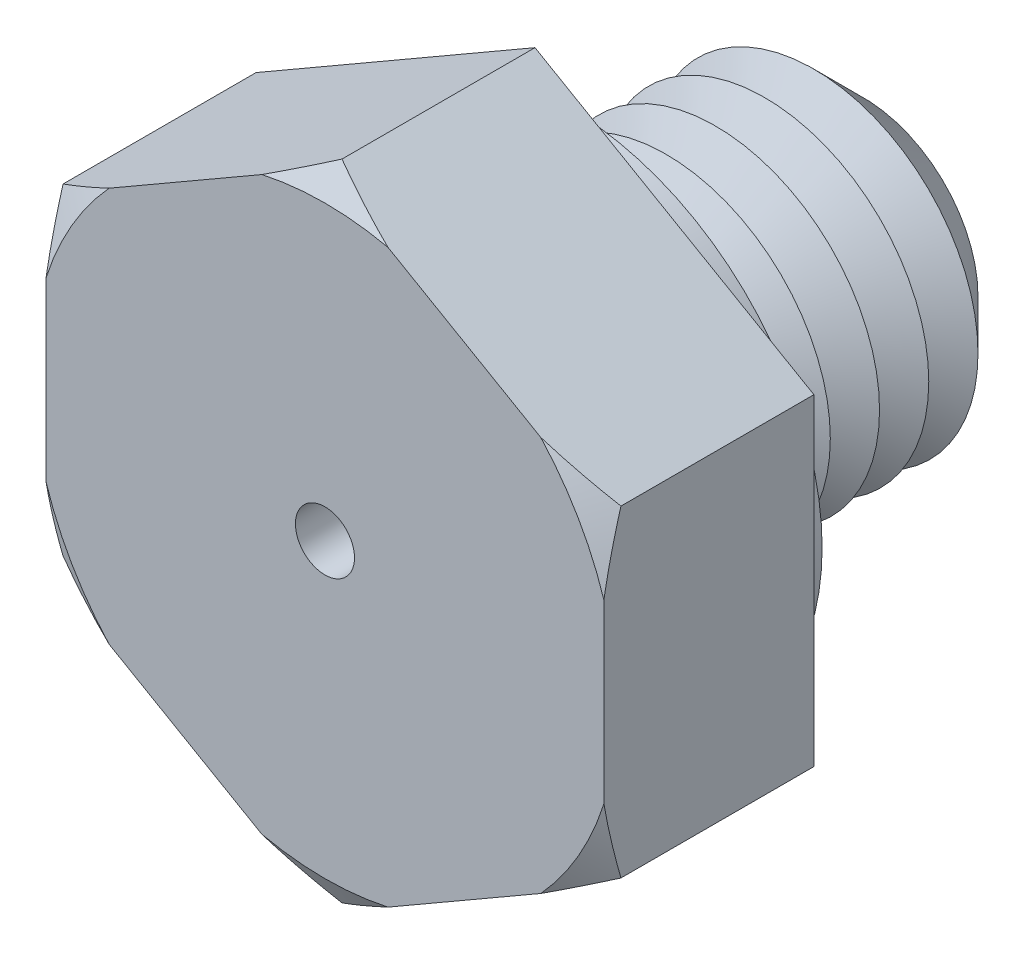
ISO-10303-21;
HEADER;
FILE_DESCRIPTION(('STEP AP214'),'2;1');
FILE_NAME('part.step','',(''),(''),'','','');
FILE_SCHEMA(('AUTOMOTIVE_DESIGN { 1 0 10303 214 1 1 1 1 }'));
ENDSEC;
DATA;
#1=APPLICATION_CONTEXT('core data for automotive mechanical design processes');
#2=APPLICATION_PROTOCOL_DEFINITION('international standard','automotive_design',2000,#1);
#3=PRODUCT_CONTEXT('',#1,'mechanical');
#4=PRODUCT('Part','Part','',(#3));
#5=PRODUCT_RELATED_PRODUCT_CATEGORY('part','',(#4));
#6=PRODUCT_DEFINITION_FORMATION('','',#4);
#7=PRODUCT_DEFINITION_CONTEXT('part definition',#1,'design');
#8=PRODUCT_DEFINITION('design','',#6,#7);
#9=PRODUCT_DEFINITION_SHAPE('','',#8);
#10=(LENGTH_UNIT() NAMED_UNIT(*) SI_UNIT(.MILLI.,.METRE.));
#11=(NAMED_UNIT(*) PLANE_ANGLE_UNIT() SI_UNIT($,.RADIAN.));
#12=(NAMED_UNIT(*) SI_UNIT($,.STERADIAN.) SOLID_ANGLE_UNIT());
#13=UNCERTAINTY_MEASURE_WITH_UNIT(LENGTH_MEASURE(1.E-05),#10,'distance_accuracy_value','');
#14=(GEOMETRIC_REPRESENTATION_CONTEXT(3) GLOBAL_UNCERTAINTY_ASSIGNED_CONTEXT((#13)) GLOBAL_UNIT_ASSIGNED_CONTEXT((#10,
#11,#12)) REPRESENTATION_CONTEXT('',''));
#15=CARTESIAN_POINT('',(0.,0.,0.));
#16=DIRECTION('',(0.,0.,1.));
#17=DIRECTION('',(1.,0.,0.));
#18=AXIS2_PLACEMENT_3D('',#15,#16,#17);
#19=CARTESIAN_POINT('',(8.5,4.90747728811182,6.4));
#20=DIRECTION('',(-0.5,-0.866025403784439,0.));
#21=DIRECTION('',(0.866025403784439,-0.5,0.));
#22=AXIS2_PLACEMENT_3D('',#19,#20,#21);
#23=PLANE('',#22);
#24=CARTESIAN_POINT('',(14.3974196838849,1.50260044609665,3.18954977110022));
#25=CARTESIAN_POINT('',(14.1303849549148,1.65677301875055,3.33361874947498));
#26=CARTESIAN_POINT('',(13.8627107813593,1.81131477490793,3.47613168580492));
#27=CARTESIAN_POINT('',(13.3258139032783,2.12129233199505,3.75731467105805));
#28=CARTESIAN_POINT('',(13.0565910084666,2.27672824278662,3.89598423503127));
#29=CARTESIAN_POINT('',(12.5155257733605,2.58911240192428,4.16915145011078));
#30=CARTESIAN_POINT('',(12.2436777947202,2.74606390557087,4.30363425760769));
#31=CARTESIAN_POINT('',(11.697943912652,3.06114350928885,4.56695627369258));
#32=CARTESIAN_POINT('',(11.4240580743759,3.21927157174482,4.69579566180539));
#33=CARTESIAN_POINT('',(10.8669438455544,3.54092162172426,4.94977636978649));
#34=CARTESIAN_POINT('',(10.5836547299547,3.70447866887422,5.07474091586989));
#35=CARTESIAN_POINT('',(10.0142178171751,4.03324322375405,5.31575754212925));
#36=CARTESIAN_POINT('',(9.72806988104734,4.19845081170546,5.43180918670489));
#37=CARTESIAN_POINT('',(9.15284957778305,4.53055440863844,5.6527883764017));
#38=CARTESIAN_POINT('',(8.86378033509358,4.69744861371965,5.75772666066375));
#39=CARTESIAN_POINT('',(8.28224800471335,5.03319646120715,5.95405449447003));
#40=CARTESIAN_POINT('',(7.98978536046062,5.20204984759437,6.04544579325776));
#41=CARTESIAN_POINT('',(7.29029341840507,5.60590170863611,6.24311258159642));
#42=CARTESIAN_POINT('',(6.88163396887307,5.8418413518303,6.34201308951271));
#43=CARTESIAN_POINT('',(6.26447173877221,6.1981601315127,6.46082851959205));
#44=CARTESIAN_POINT('',(6.0580654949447,6.31732883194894,6.49551015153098));
#45=CARTESIAN_POINT('',(5.64409758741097,6.5563333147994,6.55416143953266));
#46=CARTESIAN_POINT('',(5.43653593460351,6.67616909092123,6.57813119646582));
#47=CARTESIAN_POINT('',(5.02306823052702,6.91488478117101,6.6144556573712));
#48=CARTESIAN_POINT('',(4.81717088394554,7.03375966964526,6.62694180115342));
#49=CARTESIAN_POINT('',(4.40509314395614,7.27167286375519,6.64040244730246));
#50=CARTESIAN_POINT('',(4.19891275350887,7.39071116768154,6.64137706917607));
#51=CARTESIAN_POINT('',(3.7867555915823,7.62867021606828,6.63178359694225));
#52=CARTESIAN_POINT('',(3.58077881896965,7.747590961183,6.62121556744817));
#53=CARTESIAN_POINT('',(3.16946579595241,7.9850626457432,6.58885652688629));
#54=CARTESIAN_POINT('',(2.96412965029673,8.10361352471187,6.56706376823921));
#55=CARTESIAN_POINT('',(2.47890311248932,8.38375919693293,6.50285520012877));
#56=CARTESIAN_POINT('',(2.19947000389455,8.54508997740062,6.45579627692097));
#57=CARTESIAN_POINT('',(1.64328177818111,8.86620539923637,6.34397240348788));
#58=CARTESIAN_POINT('',(1.36652705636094,9.02598981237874,6.27920487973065));
#59=CARTESIAN_POINT('',(0.815728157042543,9.34399370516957,6.13440902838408));
#60=CARTESIAN_POINT('',(0.541687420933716,9.50221119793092,6.05436342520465));
#61=CARTESIAN_POINT('',(-0.00331670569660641,9.8168694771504,5.88153285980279));
#62=CARTESIAN_POINT('',(-0.27428028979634,9.97331037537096,5.788748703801));
#63=CARTESIAN_POINT('',(-0.816522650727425,10.2863741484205,5.59147835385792));
#64=CARTESIAN_POINT('',(-1.08776675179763,10.4429770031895,5.48686595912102));
#65=CARTESIAN_POINT('',(-1.6273814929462,10.7545237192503,5.26886764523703));
#66=CARTESIAN_POINT('',(-1.89575390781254,10.9094686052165,5.15548754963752));
#67=CARTESIAN_POINT('',(-2.43005320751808,11.2179464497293,4.92150983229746));
#68=CARTESIAN_POINT('',(-2.69598059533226,11.3714796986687,4.80091373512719));
#69=CARTESIAN_POINT('',(-3.2257511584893,11.6773428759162,4.55376737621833));
#70=CARTESIAN_POINT('',(-3.48959429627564,11.829672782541,4.42721700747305));
#71=CARTESIAN_POINT('',(-3.93372596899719,12.0860923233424,4.20929972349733));
#72=CARTESIAN_POINT('',(-4.1144919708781,12.1904576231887,4.1192248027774));
#73=CARTESIAN_POINT('',(-4.4752372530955,12.3987340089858,3.93701701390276));
#74=CARTESIAN_POINT('',(-4.65521655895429,12.5026451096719,3.84488421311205));
#75=CARTESIAN_POINT('',(-5.01258669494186,12.7089728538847,3.65977671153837));
#76=CARTESIAN_POINT('',(-5.18998489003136,12.8113937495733,3.56682094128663));
#77=CARTESIAN_POINT('',(-5.54415606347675,13.0158745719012,3.3793246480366));
#78=CARTESIAN_POINT('',(-5.72092903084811,13.1179344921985,3.28478409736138));
#79=CARTESIAN_POINT('',(-5.89741968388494,13.2198314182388,3.18954977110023));
#80=B_SPLINE_CURVE_WITH_KNOTS('',3,(#24,#25,#26,#27,#28,#29,#30,#31,#32,#33,#34,#35,#36,#37,#38,
#39,#40,#41,#42,#43,#44,#45,#46,#47,#48,#49,#50,#51,#52,#53,#54,#55,#56,#57,#58,#59,#60,#61,#62,
#63,#64,#65,#66,#67,#68,#69,#70,#71,#72,#73,#74,#75,#76,#77,#78,#79),.UNSPECIFIED.,.F.,.F.,(4,2,
2,2,2,2,2,2,2,2,2,2,2,2,2,2,2,2,2,2,2,2,2,2,2,2,2,4),(0.,1.02103660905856,2.04220146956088,
3.06664888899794,4.09106369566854,5.14147070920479,6.19192902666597,7.24136281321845,
8.29066097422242,9.73548564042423,10.45782862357,11.1801648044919,11.8941264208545,
12.6080806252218,13.3220308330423,14.036092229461,15.0137259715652,15.9915018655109,
16.9703899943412,17.9492161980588,18.939699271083,19.9295300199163,20.9191523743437,
21.9087925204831,22.5907917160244,23.272768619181,23.947601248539,24.622445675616),.UNSPECIFIED.);
#81=CARTESIAN_POINT('',(8.5,4.90747728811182,5.88038475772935));
#82=VERTEX_POINT('',#81);
#83=CARTESIAN_POINT('',(6.57804882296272,6.01711631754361,6.4));
#84=VERTEX_POINT('',#83);
#85=EDGE_CURVE('E132',#82,#84,#80,.T.);
#86=ORIENTED_EDGE('',*,*,#85,.F.);
#87=DIRECTION('',(0.,0.,-1.));
#88=VECTOR('',#87,1.);
#89=CARTESIAN_POINT('',(8.5,4.90747728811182,6.4));
#90=LINE('',#89,#88);
#91=CARTESIAN_POINT('',(8.5,4.90747728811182,0.));
#92=VERTEX_POINT('',#91);
#93=EDGE_CURVE('E144',#82,#92,#90,.T.);
#94=ORIENTED_EDGE('',*,*,#93,.T.);
#95=DIRECTION('',(-0.866025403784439,0.5,0.));
#96=VECTOR('',#95,1.);
#97=CARTESIAN_POINT('',(8.5,4.90747728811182,0.));
#98=LINE('',#97,#96);
#99=CARTESIAN_POINT('',(0.,9.81495457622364,0.));
#100=VERTEX_POINT('',#99);
#101=EDGE_CURVE('E236',#92,#100,#98,.T.);
#102=ORIENTED_EDGE('',*,*,#101,.T.);
#103=DIRECTION('',(0.,0.,-1.));
#104=VECTOR('',#103,1.);
#105=CARTESIAN_POINT('',(0.,9.81495457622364,6.4));
#106=LINE('',#105,#104);
#107=CARTESIAN_POINT('',(0.,9.81495457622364,5.88038475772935));
#108=VERTEX_POINT('',#107);
#109=EDGE_CURVE('E178',#108,#100,#106,.T.);
#110=ORIENTED_EDGE('',*,*,#109,.F.);
#111=CARTESIAN_POINT('',(1.92195117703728,8.70531554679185,6.4));
#112=VERTEX_POINT('',#111);
#113=EDGE_CURVE('E151',#112,#108,#80,.T.);
#114=ORIENTED_EDGE('',*,*,#113,.F.);
#115=DIRECTION('',(-0.866025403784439,0.5,0.));
#116=VECTOR('',#115,1.);
#117=CARTESIAN_POINT('',(8.5,4.90747728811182,6.4));
#118=LINE('',#117,#116);
#119=EDGE_CURVE('E148',#84,#112,#118,.T.);
#120=ORIENTED_EDGE('',*,*,#119,.F.);
#121=EDGE_LOOP('',(#86,#94,#102,#110,#114,#120));
#122=FACE_BOUND('',#121,.T.);
#123=ADVANCED_FACE('F39',(#122),#23,.F.);
#124=CARTESIAN_POINT('',(0.,9.81495457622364,6.4));
#125=DIRECTION('',(0.5,-0.866025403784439,0.));
#126=DIRECTION('',(0.866025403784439,0.5,0.));
#127=AXIS2_PLACEMENT_3D('',#124,#125,#126);
#128=PLANE('',#127);
#129=CARTESIAN_POINT('',(5.89741968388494,13.2198314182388,3.18954977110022));
#130=CARTESIAN_POINT('',(5.63038495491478,13.0656588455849,3.33361874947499));
#131=CARTESIAN_POINT('',(5.36271078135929,12.9111170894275,3.47613168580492));
#132=CARTESIAN_POINT('',(4.82581390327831,12.6011395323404,3.75731467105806));
#133=CARTESIAN_POINT('',(4.55659100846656,12.4457036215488,3.89598423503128));
#134=CARTESIAN_POINT('',(4.01552577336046,12.1333194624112,4.16915145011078));
#135=CARTESIAN_POINT('',(3.74367779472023,11.9763679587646,4.30363425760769));
#136=CARTESIAN_POINT('',(3.19794391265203,11.6612883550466,4.56695627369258));
#137=CARTESIAN_POINT('',(2.92405807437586,11.5031602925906,4.69579566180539));
#138=CARTESIAN_POINT('',(2.36694384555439,11.1815102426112,4.9497763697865));
#139=CARTESIAN_POINT('',(2.08365472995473,11.0179531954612,5.0747409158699));
#140=CARTESIAN_POINT('',(1.51421781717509,10.6891886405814,5.31575754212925));
#141=CARTESIAN_POINT('',(1.22806988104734,10.52398105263,5.4318091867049));
#142=CARTESIAN_POINT('',(0.652849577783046,10.191877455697,5.6527883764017));
#143=CARTESIAN_POINT('',(0.363780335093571,10.0249832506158,5.75772666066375));
#144=CARTESIAN_POINT('',(-0.21775199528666,9.68923540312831,5.95405449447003));
#145=CARTESIAN_POINT('',(-0.510214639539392,9.52038201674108,6.04544579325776));
#146=CARTESIAN_POINT('',(-1.20970658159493,9.11653015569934,6.24311258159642));
#147=CARTESIAN_POINT('',(-1.61836603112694,8.88059051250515,6.34201308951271));
#148=CARTESIAN_POINT('',(-2.2355282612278,8.52427173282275,6.46082851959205));
#149=CARTESIAN_POINT('',(-2.44193450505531,8.40510303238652,6.49551015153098));
#150=CARTESIAN_POINT('',(-2.85590241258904,8.16609854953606,6.55416143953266));
#151=CARTESIAN_POINT('',(-3.06346406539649,8.04626277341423,6.57813119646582));
#152=CARTESIAN_POINT('',(-3.47693176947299,7.80754708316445,6.6144556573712));
#153=CARTESIAN_POINT('',(-3.68282911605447,7.6886721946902,6.62694180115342));
#154=CARTESIAN_POINT('',(-4.09490685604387,7.45075900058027,6.64040244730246));
#155=CARTESIAN_POINT('',(-4.30108724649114,7.33172069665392,6.64137706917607));
#156=CARTESIAN_POINT('',(-4.71324440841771,7.09376164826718,6.63178359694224));
#157=CARTESIAN_POINT('',(-4.91922118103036,6.97484090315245,6.62121556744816));
#158=CARTESIAN_POINT('',(-5.3305342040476,6.73736921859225,6.58885652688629));
#159=CARTESIAN_POINT('',(-5.53587034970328,6.61881833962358,6.56706376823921));
#160=CARTESIAN_POINT('',(-6.02109688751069,6.33867266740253,6.50285520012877));
#161=CARTESIAN_POINT('',(-6.30052999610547,6.17734188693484,6.45579627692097));
#162=CARTESIAN_POINT('',(-6.8567182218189,5.85622646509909,6.34397240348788));
#163=CARTESIAN_POINT('',(-7.13347294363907,5.69644205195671,6.27920487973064));
#164=CARTESIAN_POINT('',(-7.68427184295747,5.37843815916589,6.13440902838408));
#165=CARTESIAN_POINT('',(-7.9583125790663,5.22022066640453,6.05436342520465));
#166=CARTESIAN_POINT('',(-8.50331670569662,4.90556238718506,5.88153285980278));
#167=CARTESIAN_POINT('',(-8.77428028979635,4.74912148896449,5.788748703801));
#168=CARTESIAN_POINT('',(-9.31652265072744,4.43605771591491,5.59147835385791));
#169=CARTESIAN_POINT('',(-9.58776675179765,4.27945486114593,5.48686595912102));
#170=CARTESIAN_POINT('',(-10.1273814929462,3.96790814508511,5.26886764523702));
#171=CARTESIAN_POINT('',(-10.3957539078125,3.81296325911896,5.15548754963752));
#172=CARTESIAN_POINT('',(-10.9300532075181,3.50448541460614,4.92150983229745));
#173=CARTESIAN_POINT('',(-11.1959805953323,3.35095216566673,4.80091373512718));
#174=CARTESIAN_POINT('',(-11.7257511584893,3.04508898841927,4.55376737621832));
#175=CARTESIAN_POINT('',(-11.9895942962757,2.89275908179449,4.42721700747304));
#176=CARTESIAN_POINT('',(-12.4337259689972,2.63633954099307,4.20929972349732));
#177=CARTESIAN_POINT('',(-12.6144919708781,2.53197424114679,4.11922480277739));
#178=CARTESIAN_POINT('',(-12.9752372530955,2.32369785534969,3.93701701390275));
#179=CARTESIAN_POINT('',(-13.1552165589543,2.21978675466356,3.84488421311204));
#180=CARTESIAN_POINT('',(-13.5125866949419,2.0134590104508,3.65977671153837));
#181=CARTESIAN_POINT('',(-13.6899848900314,1.91103811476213,3.56682094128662));
#182=CARTESIAN_POINT('',(-14.0441560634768,1.70655729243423,3.37932464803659));
#183=CARTESIAN_POINT('',(-14.2209290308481,1.60449737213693,3.28478409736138));
#184=CARTESIAN_POINT('',(-14.3974196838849,1.50260044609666,3.18954977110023));
#185=B_SPLINE_CURVE_WITH_KNOTS('',3,(#129,#130,#131,#132,#133,#134,#135,#136,#137,#138,#139,
#140,#141,#142,#143,#144,#145,#146,#147,#148,#149,#150,#151,#152,#153,#154,#155,#156,#157,#158,
#159,#160,#161,#162,#163,#164,#165,#166,#167,#168,#169,#170,#171,#172,#173,#174,#175,#176,#177,
#178,#179,#180,#181,#182,#183,#184),.UNSPECIFIED.,.F.,.F.,(4,2,2,2,2,2,2,2,2,2,2,2,2,2,2,2,2,2,
2,2,2,2,2,2,2,2,2,4),(0.,1.02103660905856,2.04220146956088,3.06664888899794,4.09106369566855,
5.1414707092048,6.19192902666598,7.24136281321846,8.29066097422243,9.73548564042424,
10.45782862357,11.1801648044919,11.8941264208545,12.6080806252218,13.3220308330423,
14.036092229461,15.0137259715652,15.991501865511,16.9703899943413,17.9492161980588,
18.939699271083,19.9295300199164,20.9191523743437,21.9087925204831,22.5907917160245,
23.272768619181,23.947601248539,24.622445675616),.UNSPECIFIED.);
#186=CARTESIAN_POINT('',(-1.92195117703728,8.70531554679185,6.4));
#187=VERTEX_POINT('',#186);
#188=EDGE_CURVE('E310',#108,#187,#185,.T.);
#189=ORIENTED_EDGE('',*,*,#188,.F.);
#190=ORIENTED_EDGE('',*,*,#109,.T.);
#191=DIRECTION('',(-0.866025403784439,-0.5,0.));
#192=VECTOR('',#191,1.);
#193=CARTESIAN_POINT('',(0.,9.81495457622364,0.));
#194=LINE('',#193,#192);
#195=CARTESIAN_POINT('',(-8.5,4.90747728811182,0.));
#196=VERTEX_POINT('',#195);
#197=EDGE_CURVE('E238',#100,#196,#194,.T.);
#198=ORIENTED_EDGE('',*,*,#197,.T.);
#199=DIRECTION('',(0.,0.,-1.));
#200=VECTOR('',#199,1.);
#201=CARTESIAN_POINT('',(-8.5,4.90747728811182,6.4));
#202=LINE('',#201,#200);
#203=CARTESIAN_POINT('',(-8.5,4.90747728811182,5.88038475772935));
#204=VERTEX_POINT('',#203);
#205=EDGE_CURVE('E175',#204,#196,#202,.T.);
#206=ORIENTED_EDGE('',*,*,#205,.F.);
#207=CARTESIAN_POINT('',(-6.57804882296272,6.01711631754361,6.4));
#208=VERTEX_POINT('',#207);
#209=EDGE_CURVE('E302',#208,#204,#185,.T.);
#210=ORIENTED_EDGE('',*,*,#209,.F.);
#211=DIRECTION('',(-0.866025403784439,-0.5,0.));
#212=VECTOR('',#211,1.);
#213=CARTESIAN_POINT('',(0.,9.81495457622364,6.4));
#214=LINE('',#213,#212);
#215=EDGE_CURVE('E216',#187,#208,#214,.T.);
#216=ORIENTED_EDGE('',*,*,#215,.F.);
#217=EDGE_LOOP('',(#189,#190,#198,#206,#210,#216));
#218=FACE_BOUND('',#217,.T.);
#219=ADVANCED_FACE('F316',(#218),#128,.F.);
#220=CARTESIAN_POINT('',(-8.5,4.90747728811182,6.4));
#221=DIRECTION('',(1.,0.,0.));
#222=DIRECTION('',(0.,0.,-1.));
#223=AXIS2_PLACEMENT_3D('',#220,#221,#222);
#224=PLANE('',#223);
#225=CARTESIAN_POINT('',(-8.5,10.8048969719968,3.60988571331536));
#226=CARTESIAN_POINT('',(-8.5,10.4978348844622,3.74918346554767));
#227=CARTESIAN_POINT('',(-8.5,10.189932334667,3.88666386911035));
#228=CARTESIAN_POINT('',(-8.5,9.57208629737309,4.15710808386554));
#229=CARTESIAN_POINT('',(-8.5,9.26214245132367,4.29007107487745));
#230=CARTESIAN_POINT('',(-8.5,8.63866338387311,4.55109231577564));
#231=CARTESIAN_POINT('',(-8.5,8.32511856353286,4.67912772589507));
#232=CARTESIAN_POINT('',(-8.5,7.69537699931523,4.92848462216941));
#233=CARTESIAN_POINT('',(-8.5,7.37918037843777,5.04980641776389));
#234=CARTESIAN_POINT('',(-8.5,6.74517674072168,5.28371307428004));
#235=CARTESIAN_POINT('',(-8.5,6.4273834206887,5.39633487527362));
#236=CARTESIAN_POINT('',(-8.5,5.78839893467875,5.61161420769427));
#237=CARTESIAN_POINT('',(-8.5,5.46720760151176,5.7142712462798));
#238=CARTESIAN_POINT('',(-8.5,4.82159629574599,5.90726308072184));
#239=CARTESIAN_POINT('',(-8.5,4.49718135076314,5.99761456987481));
#240=CARTESIAN_POINT('',(-8.5,3.84456693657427,6.16359045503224));
#241=CARTESIAN_POINT('',(-8.5,3.51636763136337,6.23921548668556));
#242=CARTESIAN_POINT('',(-8.5,2.94974096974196,6.35404738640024));
#243=CARTESIAN_POINT('',(-8.5,2.71217469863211,6.39750509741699));
#244=CARTESIAN_POINT('',(-8.5,2.2354523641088,6.47441576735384));
#245=CARTESIAN_POINT('',(-8.5,1.99629657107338,6.50787038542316));
#246=CARTESIAN_POINT('',(-8.5,1.51674855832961,6.56389930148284));
#247=CARTESIAN_POINT('',(-8.5,1.27635657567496,6.58647561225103));
#248=CARTESIAN_POINT('',(-8.5,0.794760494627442,6.62010098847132));
#249=CARTESIAN_POINT('',(-8.5,0.553556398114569,6.63115008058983));
#250=CARTESIAN_POINT('',(-8.5,0.0710159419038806,6.64137634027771));
#251=CARTESIAN_POINT('',(-8.5,-0.170320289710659,6.64055949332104));
#252=CARTESIAN_POINT('',(-8.5,-0.65265778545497,6.62709447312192));
#253=CARTESIAN_POINT('',(-8.5,-0.893659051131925,6.61444635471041));
#254=CARTESIAN_POINT('',(-8.5,-1.3748063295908,6.57770491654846));
#255=CARTESIAN_POINT('',(-8.5,-1.61495224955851,6.55361039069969));
#256=CARTESIAN_POINT('',(-8.5,-2.09391419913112,6.49466927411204));
#257=CARTESIAN_POINT('',(-8.5,-2.33273017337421,6.45982223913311));
#258=CARTESIAN_POINT('',(-8.5,-2.92716537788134,6.36046793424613));
#259=CARTESIAN_POINT('',(-8.5,-3.28176466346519,6.28983043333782));
#260=CARTESIAN_POINT('',(-8.5,-3.98672843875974,6.12983266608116));
#261=CARTESIAN_POINT('',(-8.5,-4.33709179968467,6.04046752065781));
#262=CARTESIAN_POINT('',(-8.5,-5.03425422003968,5.84616571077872));
#263=CARTESIAN_POINT('',(-8.5,-5.38104385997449,5.74119557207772));
#264=CARTESIAN_POINT('',(-8.5,-6.07054103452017,5.51879279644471));
#265=CARTESIAN_POINT('',(-8.5,-6.41324885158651,5.40136102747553));
#266=CARTESIAN_POINT('',(-8.5,-7.0989182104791,5.15508322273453));
#267=CARTESIAN_POINT('',(-8.5,-7.4418383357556,5.02612259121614));
#268=CARTESIAN_POINT('',(-8.5,-8.12447486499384,4.75996128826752));
#269=CARTESIAN_POINT('',(-8.5,-8.46419106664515,4.62276010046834));
#270=CARTESIAN_POINT('',(-8.5,-9.13876623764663,4.34260011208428));
#271=CARTESIAN_POINT('',(-8.5,-9.47364225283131,4.1996821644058));
#272=CARTESIAN_POINT('',(-8.5,-10.1409696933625,3.90850505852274));
#273=CARTESIAN_POINT('',(-8.5,-10.4734216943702,3.76024722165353));
#274=CARTESIAN_POINT('',(-8.5,-10.8048969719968,3.60988571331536));
#275=B_SPLINE_CURVE_WITH_KNOTS('',3,(#225,#226,#227,#228,#229,#230,#231,#232,#233,#234,#235,
#236,#237,#238,#239,#240,#241,#242,#243,#244,#245,#246,#247,#248,#249,#250,#251,#252,#253,#254,
#255,#256,#257,#258,#259,#260,#261,#262,#263,#264,#265,#266,#267,#268,#269,#270,#271,#272,#273,
#274),.UNSPECIFIED.,.F.,.F.,(4,2,2,2,2,2,2,2,2,2,2,2,2,2,2,2,2,2,2,2,2,2,2,2,4),(0.,
1.01155870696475,2.02330010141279,3.03927305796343,4.05519914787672,5.06654285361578,
6.07793655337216,7.08794426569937,8.0979083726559,8.82224854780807,9.54646851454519,
10.2705544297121,10.9946386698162,11.7183576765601,12.4420733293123,13.1658652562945,
13.8896870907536,14.9737367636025,16.0580692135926,17.1447621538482,18.2313794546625,
19.3303511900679,20.4293918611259,21.5216359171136,22.6136115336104),.UNSPECIFIED.);
#276=CARTESIAN_POINT('',(-8.5,2.68819922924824,6.4));
#277=VERTEX_POINT('',#276);
#278=EDGE_CURVE('E223',#204,#277,#275,.T.);
#279=ORIENTED_EDGE('',*,*,#278,.F.);
#280=ORIENTED_EDGE('',*,*,#205,.T.);
#281=DIRECTION('',(0.,-1.,0.));
#282=VECTOR('',#281,1.);
#283=CARTESIAN_POINT('',(-8.5,4.90747728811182,0.));
#284=LINE('',#283,#282);
#285=CARTESIAN_POINT('',(-8.5,-4.90747728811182,0.));
#286=VERTEX_POINT('',#285);
#287=EDGE_CURVE('E243',#196,#286,#284,.T.);
#288=ORIENTED_EDGE('',*,*,#287,.T.);
#289=DIRECTION('',(0.,0.,-1.));
#290=VECTOR('',#289,1.);
#291=CARTESIAN_POINT('',(-8.5,-4.90747728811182,6.4));
#292=LINE('',#291,#290);
#293=CARTESIAN_POINT('',(-8.5,-4.90747728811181,5.88038475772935));
#294=VERTEX_POINT('',#293);
#295=EDGE_CURVE('E172',#294,#286,#292,.T.);
#296=ORIENTED_EDGE('',*,*,#295,.F.);
#297=CARTESIAN_POINT('',(-8.5,-2.68819922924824,6.4));
#298=VERTEX_POINT('',#297);
#299=EDGE_CURVE('E226',#298,#294,#275,.T.);
#300=ORIENTED_EDGE('',*,*,#299,.F.);
#301=DIRECTION('',(0.,-1.,0.));
#302=VECTOR('',#301,1.);
#303=CARTESIAN_POINT('',(-8.5,4.90747728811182,6.4));
#304=LINE('',#303,#302);
#305=EDGE_CURVE('E214',#277,#298,#304,.T.);
#306=ORIENTED_EDGE('',*,*,#305,.F.);
#307=EDGE_LOOP('',(#279,#280,#288,#296,#300,#306));
#308=FACE_BOUND('',#307,.T.);
#309=ADVANCED_FACE('F222',(#308),#224,.F.);
#310=CARTESIAN_POINT('',(-8.5,-4.90747728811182,6.4));
#311=DIRECTION('',(0.5,0.866025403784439,0.));
#312=DIRECTION('',(-0.866025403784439,0.5,0.));
#313=AXIS2_PLACEMENT_3D('',#310,#311,#312);
#314=PLANE('',#313);
#315=CARTESIAN_POINT('',(-14.3974196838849,-1.50260044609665,3.18954977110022));
#316=CARTESIAN_POINT('',(-14.1303849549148,-1.65677301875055,3.33361874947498));
#317=CARTESIAN_POINT('',(-13.8627107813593,-1.81131477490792,3.47613168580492));
#318=CARTESIAN_POINT('',(-13.3258139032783,-2.12129233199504,3.75731467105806));
#319=CARTESIAN_POINT('',(-13.0565910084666,-2.27672824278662,3.89598423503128));
#320=CARTESIAN_POINT('',(-12.5155257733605,-2.58911240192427,4.16915145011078));
#321=CARTESIAN_POINT('',(-12.2436777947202,-2.74606390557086,4.30363425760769));
#322=CARTESIAN_POINT('',(-11.697943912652,-3.06114350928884,4.56695627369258));
#323=CARTESIAN_POINT('',(-11.4240580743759,-3.21927157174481,4.69579566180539));
#324=CARTESIAN_POINT('',(-10.8669438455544,-3.54092162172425,4.94977636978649));
#325=CARTESIAN_POINT('',(-10.5836547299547,-3.70447866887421,5.07474091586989));
#326=CARTESIAN_POINT('',(-10.0142178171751,-4.03324322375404,5.31575754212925));
#327=CARTESIAN_POINT('',(-9.72806988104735,-4.19845081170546,5.43180918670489));
#328=CARTESIAN_POINT('',(-9.15284957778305,-4.53055440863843,5.6527883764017));
#329=CARTESIAN_POINT('',(-8.86378033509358,-4.69744861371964,5.75772666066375));
#330=CARTESIAN_POINT('',(-8.28224800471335,-5.03319646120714,5.95405449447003));
#331=CARTESIAN_POINT('',(-7.98978536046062,-5.20204984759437,6.04544579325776));
#332=CARTESIAN_POINT('',(-7.29029341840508,-5.60590170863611,6.24311258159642));
#333=CARTESIAN_POINT('',(-6.88163396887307,-5.84184135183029,6.34201308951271));
#334=CARTESIAN_POINT('',(-6.26447173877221,-6.1981601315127,6.46082851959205));
#335=CARTESIAN_POINT('',(-6.0580654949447,-6.31732883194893,6.49551015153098));
#336=CARTESIAN_POINT('',(-5.64409758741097,-6.55633331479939,6.55416143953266));
#337=CARTESIAN_POINT('',(-5.43653593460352,-6.67616909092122,6.57813119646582));
#338=CARTESIAN_POINT('',(-5.02306823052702,-6.914884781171,6.6144556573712));
#339=CARTESIAN_POINT('',(-4.81717088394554,-7.03375966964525,6.62694180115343));
#340=CARTESIAN_POINT('',(-4.40509314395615,-7.27167286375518,6.64040244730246));
#341=CARTESIAN_POINT('',(-4.19891275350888,-7.39071116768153,6.64137706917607));
#342=CARTESIAN_POINT('',(-3.78675559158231,-7.62867021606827,6.63178359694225));
#343=CARTESIAN_POINT('',(-3.58077881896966,-7.74759096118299,6.62121556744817));
#344=CARTESIAN_POINT('',(-3.16946579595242,-7.98506264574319,6.58885652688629));
#345=CARTESIAN_POINT('',(-2.96412965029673,-8.10361352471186,6.56706376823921));
#346=CARTESIAN_POINT('',(-2.47890311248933,-8.38375919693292,6.50285520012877));
#347=CARTESIAN_POINT('',(-2.19947000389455,-8.54508997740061,6.45579627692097));
#348=CARTESIAN_POINT('',(-1.64328177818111,-8.86620539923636,6.34397240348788));
#349=CARTESIAN_POINT('',(-1.36652705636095,-9.02598981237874,6.27920487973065));
#350=CARTESIAN_POINT('',(-0.815728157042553,-9.34399370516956,6.13440902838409));
#351=CARTESIAN_POINT('',(-0.541687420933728,-9.50221119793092,6.05436342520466));
#352=CARTESIAN_POINT('',(0.00331670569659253,-9.81686947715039,5.8815328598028));
#353=CARTESIAN_POINT('',(0.274280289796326,-9.97331037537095,5.78874870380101));
#354=CARTESIAN_POINT('',(0.816522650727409,-10.2863741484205,5.59147835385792));
#355=CARTESIAN_POINT('',(1.08776675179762,-10.4429770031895,5.48686595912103));
#356=CARTESIAN_POINT('',(1.62738149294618,-10.7545237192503,5.26886764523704));
#357=CARTESIAN_POINT('',(1.89575390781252,-10.9094686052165,5.15548754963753));
#358=CARTESIAN_POINT('',(2.43005320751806,-11.2179464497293,4.92150983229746));
#359=CARTESIAN_POINT('',(2.69598059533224,-11.3714796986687,4.8009137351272));
#360=CARTESIAN_POINT('',(3.22575115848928,-11.6773428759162,4.55376737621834));
#361=CARTESIAN_POINT('',(3.48959429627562,-11.829672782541,4.42721700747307));
#362=CARTESIAN_POINT('',(3.93372596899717,-12.0860923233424,4.20929972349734));
#363=CARTESIAN_POINT('',(4.11449197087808,-12.1904576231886,4.11922480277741));
#364=CARTESIAN_POINT('',(4.47523725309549,-12.3987340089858,3.93701701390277));
#365=CARTESIAN_POINT('',(4.65521655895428,-12.5026451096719,3.84488421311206));
#366=CARTESIAN_POINT('',(5.01258669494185,-12.7089728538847,3.65977671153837));
#367=CARTESIAN_POINT('',(5.18998489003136,-12.8113937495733,3.56682094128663));
#368=CARTESIAN_POINT('',(5.54415606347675,-13.0158745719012,3.3793246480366));
#369=CARTESIAN_POINT('',(5.72092903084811,-13.1179344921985,3.28478409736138));
#370=CARTESIAN_POINT('',(5.89741968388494,-13.2198314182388,3.18954977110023));
#371=B_SPLINE_CURVE_WITH_KNOTS('',3,(#315,#316,#317,#318,#319,#320,#321,#322,#323,#324,#325,
#326,#327,#328,#329,#330,#331,#332,#333,#334,#335,#336,#337,#338,#339,#340,#341,#342,#343,#344,
#345,#346,#347,#348,#349,#350,#351,#352,#353,#354,#355,#356,#357,#358,#359,#360,#361,#362,#363,
#364,#365,#366,#367,#368,#369,#370),.UNSPECIFIED.,.F.,.F.,(4,2,2,2,2,2,2,2,2,2,2,2,2,2,2,2,2,2,
2,2,2,2,2,2,2,2,2,4),(0.,1.02103660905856,2.04220146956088,3.06664888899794,4.09106369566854,
5.14147070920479,6.19192902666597,7.24136281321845,8.29066097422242,9.73548564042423,
10.45782862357,11.1801648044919,11.8941264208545,12.6080806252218,13.3220308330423,
14.036092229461,15.0137259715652,15.9915018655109,16.9703899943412,17.9492161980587,
18.9396992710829,19.9295300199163,20.9191523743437,21.9087925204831,22.5907917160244,
23.272768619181,23.947601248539,24.622445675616),.UNSPECIFIED.);
#372=CARTESIAN_POINT('',(-6.57804882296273,-6.0171163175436,6.4));
#373=VERTEX_POINT('',#372);
#374=EDGE_CURVE('E353',#294,#373,#371,.T.);
#375=ORIENTED_EDGE('',*,*,#374,.F.);
#376=ORIENTED_EDGE('',*,*,#295,.T.);
#377=DIRECTION('',(0.866025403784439,-0.5,0.));
#378=VECTOR('',#377,1.);
#379=CARTESIAN_POINT('',(-8.5,-4.90747728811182,0.));
#380=LINE('',#379,#378);
#381=CARTESIAN_POINT('',(0.,-9.81495457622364,0.));
#382=VERTEX_POINT('',#381);
#383=EDGE_CURVE('E246',#286,#382,#380,.T.);
#384=ORIENTED_EDGE('',*,*,#383,.T.);
#385=DIRECTION('',(0.,0.,-1.));
#386=VECTOR('',#385,1.);
#387=CARTESIAN_POINT('',(0.,-9.81495457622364,6.4));
#388=LINE('',#387,#386);
#389=CARTESIAN_POINT('',(0.,-9.81495457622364,5.88038475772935));
#390=VERTEX_POINT('',#389);
#391=EDGE_CURVE('E162',#390,#382,#388,.T.);
#392=ORIENTED_EDGE('',*,*,#391,.F.);
#393=CARTESIAN_POINT('',(-1.92195117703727,-8.70531554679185,6.4));
#394=VERTEX_POINT('',#393);
#395=EDGE_CURVE('E347',#394,#390,#371,.T.);
#396=ORIENTED_EDGE('',*,*,#395,.F.);
#397=DIRECTION('',(0.866025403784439,-0.5,0.));
#398=VECTOR('',#397,1.);
#399=CARTESIAN_POINT('',(-8.5,-4.90747728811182,6.4));
#400=LINE('',#399,#398);
#401=EDGE_CURVE('E228',#373,#394,#400,.T.);
#402=ORIENTED_EDGE('',*,*,#401,.F.);
#403=EDGE_LOOP('',(#375,#376,#384,#392,#396,#402));
#404=FACE_BOUND('',#403,.T.);
#405=ADVANCED_FACE('F354',(#404),#314,.F.);
#406=CARTESIAN_POINT('',(0.,-9.81495457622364,6.4));
#407=DIRECTION('',(-0.5,0.866025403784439,0.));
#408=DIRECTION('',(-0.866025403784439,-0.5,0.));
#409=AXIS2_PLACEMENT_3D('',#406,#407,#408);
#410=PLANE('',#409);
#411=CARTESIAN_POINT('',(-5.89741968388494,-13.2198314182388,3.18954977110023));
#412=CARTESIAN_POINT('',(-5.63038495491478,-13.0656588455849,3.33361874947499));
#413=CARTESIAN_POINT('',(-5.36271078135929,-12.9111170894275,3.47613168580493));
#414=CARTESIAN_POINT('',(-4.82581390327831,-12.6011395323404,3.75731467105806));
#415=CARTESIAN_POINT('',(-4.55659100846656,-12.4457036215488,3.89598423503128));
#416=CARTESIAN_POINT('',(-4.01552577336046,-12.1333194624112,4.16915145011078));
#417=CARTESIAN_POINT('',(-3.74367779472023,-11.9763679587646,4.30363425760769));
#418=CARTESIAN_POINT('',(-3.19794391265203,-11.6612883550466,4.56695627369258));
#419=CARTESIAN_POINT('',(-2.92405807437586,-11.5031602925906,4.69579566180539));
#420=CARTESIAN_POINT('',(-2.3669438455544,-11.1815102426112,4.9497763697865));
#421=CARTESIAN_POINT('',(-2.08365472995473,-11.0179531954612,5.0747409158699));
#422=CARTESIAN_POINT('',(-1.51421781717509,-10.6891886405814,5.31575754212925));
#423=CARTESIAN_POINT('',(-1.22806988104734,-10.52398105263,5.4318091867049));
#424=CARTESIAN_POINT('',(-0.65284957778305,-10.191877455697,5.6527883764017));
#425=CARTESIAN_POINT('',(-0.363780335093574,-10.0249832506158,5.75772666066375));
#426=CARTESIAN_POINT('',(0.217751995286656,-9.68923540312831,5.95405449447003));
#427=CARTESIAN_POINT('',(0.510214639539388,-9.52038201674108,6.04544579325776));
#428=CARTESIAN_POINT('',(1.20970658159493,-9.11653015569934,6.24311258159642));
#429=CARTESIAN_POINT('',(1.61836603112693,-8.88059051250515,6.34201308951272));
#430=CARTESIAN_POINT('',(2.2355282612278,-8.52427173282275,6.46082851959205));
#431=CARTESIAN_POINT('',(2.44193450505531,-8.40510303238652,6.49551015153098));
#432=CARTESIAN_POINT('',(2.85590241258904,-8.16609854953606,6.55416143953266));
#433=CARTESIAN_POINT('',(3.06346406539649,-8.04626277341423,6.57813119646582));
#434=CARTESIAN_POINT('',(3.47693176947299,-7.80754708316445,6.6144556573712));
#435=CARTESIAN_POINT('',(3.68282911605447,-7.6886721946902,6.62694180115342));
#436=CARTESIAN_POINT('',(4.09490685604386,-7.45075900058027,6.64040244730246));
#437=CARTESIAN_POINT('',(4.30108724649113,-7.33172069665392,6.64137706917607));
#438=CARTESIAN_POINT('',(4.7132444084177,-7.09376164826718,6.63178359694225));
#439=CARTESIAN_POINT('',(4.91922118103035,-6.97484090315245,6.62121556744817));
#440=CARTESIAN_POINT('',(5.33053420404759,-6.73736921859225,6.58885652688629));
#441=CARTESIAN_POINT('',(5.53587034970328,-6.61881833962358,6.56706376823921));
#442=CARTESIAN_POINT('',(6.02109688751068,-6.33867266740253,6.50285520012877));
#443=CARTESIAN_POINT('',(6.30052999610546,-6.17734188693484,6.45579627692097));
#444=CARTESIAN_POINT('',(6.8567182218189,-5.85622646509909,6.34397240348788));
#445=CARTESIAN_POINT('',(7.13347294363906,-5.69644205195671,6.27920487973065));
#446=CARTESIAN_POINT('',(7.68427184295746,-5.37843815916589,6.13440902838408));
#447=CARTESIAN_POINT('',(7.95831257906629,-5.22022066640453,6.05436342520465));
#448=CARTESIAN_POINT('',(8.50331670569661,-4.90556238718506,5.88153285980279));
#449=CARTESIAN_POINT('',(8.77428028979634,-4.74912148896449,5.788748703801));
#450=CARTESIAN_POINT('',(9.31652265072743,-4.43605771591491,5.59147835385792));
#451=CARTESIAN_POINT('',(9.58776675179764,-4.27945486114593,5.48686595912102));
#452=CARTESIAN_POINT('',(10.1273814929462,-3.96790814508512,5.26886764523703));
#453=CARTESIAN_POINT('',(10.3957539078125,-3.81296325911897,5.15548754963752));
#454=CARTESIAN_POINT('',(10.9300532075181,-3.50448541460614,4.92150983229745));
#455=CARTESIAN_POINT('',(11.1959805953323,-3.35095216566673,4.80091373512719));
#456=CARTESIAN_POINT('',(11.7257511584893,-3.04508898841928,4.55376737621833));
#457=CARTESIAN_POINT('',(11.9895942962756,-2.8927590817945,4.42721700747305));
#458=CARTESIAN_POINT('',(12.4337259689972,-2.63633954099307,4.20929972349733));
#459=CARTESIAN_POINT('',(12.6144919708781,-2.5319742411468,4.11922480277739));
#460=CARTESIAN_POINT('',(12.9752372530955,-2.32369785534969,3.93701701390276));
#461=CARTESIAN_POINT('',(13.1552165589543,-2.21978675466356,3.84488421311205));
#462=CARTESIAN_POINT('',(13.5125866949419,-2.0134590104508,3.65977671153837));
#463=CARTESIAN_POINT('',(13.6899848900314,-1.91103811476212,3.56682094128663));
#464=CARTESIAN_POINT('',(14.0441560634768,-1.70655729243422,3.3793246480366));
#465=CARTESIAN_POINT('',(14.2209290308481,-1.60449737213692,3.28478409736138));
#466=CARTESIAN_POINT('',(14.3974196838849,-1.50260044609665,3.18954977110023));
#467=B_SPLINE_CURVE_WITH_KNOTS('',3,(#411,#412,#413,#414,#415,#416,#417,#418,#419,#420,#421,
#422,#423,#424,#425,#426,#427,#428,#429,#430,#431,#432,#433,#434,#435,#436,#437,#438,#439,#440,
#441,#442,#443,#444,#445,#446,#447,#448,#449,#450,#451,#452,#453,#454,#455,#456,#457,#458,#459,
#460,#461,#462,#463,#464,#465,#466),.UNSPECIFIED.,.F.,.F.,(4,2,2,2,2,2,2,2,2,2,2,2,2,2,2,2,2,2,
2,2,2,2,2,2,2,2,2,4),(0.,1.02103660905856,2.04220146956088,3.06664888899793,4.09106369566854,
5.14147070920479,6.19192902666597,7.24136281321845,8.29066097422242,9.73548564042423,
10.45782862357,11.1801648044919,11.8941264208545,12.6080806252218,13.3220308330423,
14.036092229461,15.0137259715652,15.9915018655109,16.9703899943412,17.9492161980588,
18.939699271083,19.9295300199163,20.9191523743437,21.9087925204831,22.5907917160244,
23.272768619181,23.947601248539,24.622445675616),.UNSPECIFIED.);
#468=CARTESIAN_POINT('',(1.92195117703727,-8.70531554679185,6.4));
#469=VERTEX_POINT('',#468);
#470=EDGE_CURVE('E64',#390,#469,#467,.T.);
#471=ORIENTED_EDGE('',*,*,#470,.F.);
#472=ORIENTED_EDGE('',*,*,#391,.T.);
#473=DIRECTION('',(0.866025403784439,0.5,0.));
#474=VECTOR('',#473,1.);
#475=CARTESIAN_POINT('',(0.,-9.81495457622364,0.));
#476=LINE('',#475,#474);
#477=CARTESIAN_POINT('',(8.5,-4.90747728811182,0.));
#478=VERTEX_POINT('',#477);
#479=EDGE_CURVE('E249',#382,#478,#476,.T.);
#480=ORIENTED_EDGE('',*,*,#479,.T.);
#481=DIRECTION('',(0.,0.,-1.));
#482=VECTOR('',#481,1.);
#483=CARTESIAN_POINT('',(8.5,-4.90747728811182,6.4));
#484=LINE('',#483,#482);
#485=CARTESIAN_POINT('',(8.5,-4.90747728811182,5.88038475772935));
#486=VERTEX_POINT('',#485);
#487=EDGE_CURVE('E157',#486,#478,#484,.T.);
#488=ORIENTED_EDGE('',*,*,#487,.F.);
#489=CARTESIAN_POINT('',(6.57804882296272,-6.01711631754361,6.4));
#490=VERTEX_POINT('',#489);
#491=EDGE_CURVE('E342',#490,#486,#467,.T.);
#492=ORIENTED_EDGE('',*,*,#491,.F.);
#493=DIRECTION('',(0.866025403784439,0.5,0.));
#494=VECTOR('',#493,1.);
#495=CARTESIAN_POINT('',(0.,-9.81495457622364,6.4));
#496=LINE('',#495,#494);
#497=EDGE_CURVE('E165',#469,#490,#496,.T.);
#498=ORIENTED_EDGE('',*,*,#497,.F.);
#499=EDGE_LOOP('',(#471,#472,#480,#488,#492,#498));
#500=FACE_BOUND('',#499,.T.);
#501=ADVANCED_FACE('F357',(#500),#410,.F.);
#502=CARTESIAN_POINT('',(8.5,-4.90747728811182,6.4));
#503=DIRECTION('',(-1.,0.,0.));
#504=DIRECTION('',(0.,-1.,0.));
#505=AXIS2_PLACEMENT_3D('',#502,#503,#504);
#506=PLANE('',#505);
#507=CARTESIAN_POINT('',(8.5,-10.8048969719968,3.60988571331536));
#508=CARTESIAN_POINT('',(8.5,-10.4978348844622,3.74918346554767));
#509=CARTESIAN_POINT('',(8.5,-10.189932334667,3.88666386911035));
#510=CARTESIAN_POINT('',(8.5,-9.57208629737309,4.15710808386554));
#511=CARTESIAN_POINT('',(8.5,-9.26214245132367,4.29007107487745));
#512=CARTESIAN_POINT('',(8.5,-8.63866338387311,4.55109231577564));
#513=CARTESIAN_POINT('',(8.5,-8.32511856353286,4.67912772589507));
#514=CARTESIAN_POINT('',(8.5,-7.69537699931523,4.92848462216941));
#515=CARTESIAN_POINT('',(8.5,-7.37918037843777,5.04980641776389));
#516=CARTESIAN_POINT('',(8.5,-6.74517674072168,5.28371307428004));
#517=CARTESIAN_POINT('',(8.5,-6.4273834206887,5.39633487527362));
#518=CARTESIAN_POINT('',(8.5,-5.78839893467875,5.61161420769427));
#519=CARTESIAN_POINT('',(8.5,-5.46720760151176,5.7142712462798));
#520=CARTESIAN_POINT('',(8.5,-4.82159629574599,5.90726308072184));
#521=CARTESIAN_POINT('',(8.5,-4.49718135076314,5.99761456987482));
#522=CARTESIAN_POINT('',(8.5,-3.84456693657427,6.16359045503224));
#523=CARTESIAN_POINT('',(8.5,-3.51636763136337,6.23921548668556));
#524=CARTESIAN_POINT('',(8.5,-2.94974096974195,6.35404738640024));
#525=CARTESIAN_POINT('',(8.5,-2.71217469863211,6.39750509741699));
#526=CARTESIAN_POINT('',(8.5,-2.23545236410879,6.47441576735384));
#527=CARTESIAN_POINT('',(8.5,-1.99629657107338,6.50787038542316));
#528=CARTESIAN_POINT('',(8.5,-1.5167485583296,6.56389930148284));
#529=CARTESIAN_POINT('',(8.5,-1.27635657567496,6.58647561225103));
#530=CARTESIAN_POINT('',(8.5,-0.79476049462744,6.62010098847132));
#531=CARTESIAN_POINT('',(8.5,-0.553556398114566,6.63115008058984));
#532=CARTESIAN_POINT('',(8.5,-0.0710159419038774,6.64137634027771));
#533=CARTESIAN_POINT('',(8.5,0.170320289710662,6.64055949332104));
#534=CARTESIAN_POINT('',(8.5,0.652657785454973,6.62709447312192));
#535=CARTESIAN_POINT('',(8.5,0.893659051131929,6.61444635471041));
#536=CARTESIAN_POINT('',(8.5,1.3748063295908,6.57770491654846));
#537=CARTESIAN_POINT('',(8.5,1.61495224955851,6.5536103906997));
#538=CARTESIAN_POINT('',(8.5,2.09391419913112,6.49466927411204));
#539=CARTESIAN_POINT('',(8.5,2.33273017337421,6.45982223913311));
#540=CARTESIAN_POINT('',(8.5,2.92716537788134,6.36046793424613));
#541=CARTESIAN_POINT('',(8.5,3.2817646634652,6.28983043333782));
#542=CARTESIAN_POINT('',(8.5,3.98672843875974,6.12983266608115));
#543=CARTESIAN_POINT('',(8.5,4.33709179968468,6.04046752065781));
#544=CARTESIAN_POINT('',(8.5,5.03425422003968,5.84616571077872));
#545=CARTESIAN_POINT('',(8.5,5.38104385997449,5.74119557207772));
#546=CARTESIAN_POINT('',(8.5,6.07054103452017,5.51879279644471));
#547=CARTESIAN_POINT('',(8.5,6.41324885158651,5.40136102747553));
#548=CARTESIAN_POINT('',(8.5,7.0989182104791,5.15508322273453));
#549=CARTESIAN_POINT('',(8.5,7.4418383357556,5.02612259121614));
#550=CARTESIAN_POINT('',(8.5,8.12447486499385,4.75996128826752));
#551=CARTESIAN_POINT('',(8.5,8.46419106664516,4.62276010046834));
#552=CARTESIAN_POINT('',(8.5,9.13876623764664,4.34260011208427));
#553=CARTESIAN_POINT('',(8.5,9.47364225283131,4.19968216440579));
#554=CARTESIAN_POINT('',(8.5,10.1409696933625,3.90850505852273));
#555=CARTESIAN_POINT('',(8.5,10.4734216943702,3.76024722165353));
#556=CARTESIAN_POINT('',(8.5,10.8048969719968,3.60988571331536));
#557=B_SPLINE_CURVE_WITH_KNOTS('',3,(#507,#508,#509,#510,#511,#512,#513,#514,#515,#516,#517,
#518,#519,#520,#521,#522,#523,#524,#525,#526,#527,#528,#529,#530,#531,#532,#533,#534,#535,#536,
#537,#538,#539,#540,#541,#542,#543,#544,#545,#546,#547,#548,#549,#550,#551,#552,#553,#554,#555,
#556),.UNSPECIFIED.,.F.,.F.,(4,2,2,2,2,2,2,2,2,2,2,2,2,2,2,2,2,2,2,2,2,2,2,2,4),(0.,
1.01155870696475,2.02330010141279,3.03927305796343,4.05519914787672,5.06654285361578,
6.07793655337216,7.08794426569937,8.0979083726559,8.82224854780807,9.54646851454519,
10.2705544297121,10.9946386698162,11.7183576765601,12.4420733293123,13.1658652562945,
13.8896870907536,14.9737367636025,16.0580692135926,17.1447621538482,18.2313794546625,
19.3303511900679,20.4293918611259,21.5216359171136,22.6136115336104),.UNSPECIFIED.);
#558=CARTESIAN_POINT('',(8.5,-2.68819922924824,6.4));
#559=VERTEX_POINT('',#558);
#560=EDGE_CURVE('E56',#486,#559,#557,.T.);
#561=ORIENTED_EDGE('',*,*,#560,.F.);
#562=ORIENTED_EDGE('',*,*,#487,.T.);
#563=DIRECTION('',(0.,1.,0.));
#564=VECTOR('',#563,1.);
#565=CARTESIAN_POINT('',(8.5,-4.90747728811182,0.));
#566=LINE('',#565,#564);
#567=EDGE_CURVE('E154',#478,#92,#566,.T.);
#568=ORIENTED_EDGE('',*,*,#567,.T.);
#569=ORIENTED_EDGE('',*,*,#93,.F.);
#570=CARTESIAN_POINT('',(8.5,2.68819922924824,6.4));
#571=VERTEX_POINT('',#570);
#572=EDGE_CURVE('E129',#571,#82,#557,.T.);
#573=ORIENTED_EDGE('',*,*,#572,.F.);
#574=DIRECTION('',(0.,1.,0.));
#575=VECTOR('',#574,1.);
#576=CARTESIAN_POINT('',(8.5,-4.90747728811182,6.4));
#577=LINE('',#576,#575);
#578=EDGE_CURVE('E158',#559,#571,#577,.T.);
#579=ORIENTED_EDGE('',*,*,#578,.F.);
#580=EDGE_LOOP('',(#561,#562,#568,#569,#573,#579));
#581=FACE_BOUND('',#580,.T.);
#582=ADVANCED_FACE('F152',(#581),#506,.F.);
#583=CARTESIAN_POINT('',(0.,0.,6.4));
#584=DIRECTION('',(0.,0.,1.));
#585=DIRECTION('',(1.,0.,0.));
#586=AXIS2_PLACEMENT_3D('',#583,#584,#585);
#587=PLANE('',#586);
#588=CARTESIAN_POINT('',(0.,0.,6.4));
#589=DIRECTION('',(0.,0.,1.));
#590=DIRECTION('',(1.,0.,0.));
#591=AXIS2_PLACEMENT_3D('',#588,#589,#590);
#592=CIRCLE('',#591,0.9);
#593=CARTESIAN_POINT('',(0.9,0.,6.4));
#594=VERTEX_POINT('',#593);
#595=EDGE_CURVE('E643',#594,#594,#592,.T.);
#596=ORIENTED_EDGE('',*,*,#595,.F.);
#597=EDGE_LOOP('',(#596));
#598=FACE_BOUND('',#597,.T.);
#599=ORIENTED_EDGE('',*,*,#578,.T.);
#600=CARTESIAN_POINT('',(0.,0.,6.4));
#601=DIRECTION('',(0.,0.,1.));
#602=DIRECTION('',(1.,0.,0.));
#603=AXIS2_PLACEMENT_3D('',#600,#601,#602);
#604=CIRCLE('',#603,8.91495457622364);
#605=EDGE_CURVE('E134',#571,#84,#604,.T.);
#606=ORIENTED_EDGE('',*,*,#605,.T.);
#607=ORIENTED_EDGE('',*,*,#119,.T.);
#608=CARTESIAN_POINT('',(0.,0.,6.4));
#609=DIRECTION('',(0.,0.,1.));
#610=DIRECTION('',(1.,0.,0.));
#611=AXIS2_PLACEMENT_3D('',#608,#609,#610);
#612=CIRCLE('',#611,8.91495457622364);
#613=EDGE_CURVE('E11',#112,#187,#612,.T.);
#614=ORIENTED_EDGE('',*,*,#613,.T.);
#615=ORIENTED_EDGE('',*,*,#215,.T.);
#616=EDGE_CURVE('E49',#208,#277,#612,.T.);
#617=ORIENTED_EDGE('',*,*,#616,.T.);
#618=ORIENTED_EDGE('',*,*,#305,.T.);
#619=EDGE_CURVE('E198',#298,#373,#612,.T.);
#620=ORIENTED_EDGE('',*,*,#619,.T.);
#621=ORIENTED_EDGE('',*,*,#401,.T.);
#622=EDGE_CURVE('E192',#394,#469,#612,.T.);
#623=ORIENTED_EDGE('',*,*,#622,.T.);
#624=ORIENTED_EDGE('',*,*,#497,.T.);
#625=EDGE_CURVE('E43',#490,#559,#612,.T.);
#626=ORIENTED_EDGE('',*,*,#625,.T.);
#627=EDGE_LOOP('',(#599,#606,#607,#614,#615,#617,#618,#620,#621,#623,#624,#626));
#628=FACE_BOUND('',#627,.T.);
#629=ADVANCED_FACE('F213',(#598,#628),#587,.T.);
#630=CARTESIAN_POINT('',(0.,0.,0.));
#631=DIRECTION('',(0.,0.,1.));
#632=DIRECTION('',(1.,0.,0.));
#633=AXIS2_PLACEMENT_3D('',#630,#631,#632);
#634=PLANE('',#633);
#635=CARTESIAN_POINT('',(0.,0.,0.));
#636=DIRECTION('',(0.,0.,1.));
#637=DIRECTION('',(1.,0.,0.));
#638=AXIS2_PLACEMENT_3D('',#635,#636,#637);
#639=CIRCLE('',#638,7.75);
#640=CARTESIAN_POINT('',(7.75,0.,0.));
#641=VERTEX_POINT('',#640);
#642=EDGE_CURVE('E181',#641,#641,#639,.F.);
#643=ORIENTED_EDGE('',*,*,#642,.F.);
#644=EDGE_LOOP('',(#643));
#645=FACE_BOUND('',#644,.T.);
#646=ORIENTED_EDGE('',*,*,#101,.F.);
#647=ORIENTED_EDGE('',*,*,#567,.F.);
#648=ORIENTED_EDGE('',*,*,#479,.F.);
#649=ORIENTED_EDGE('',*,*,#383,.F.);
#650=ORIENTED_EDGE('',*,*,#287,.F.);
#651=ORIENTED_EDGE('',*,*,#197,.F.);
#652=EDGE_LOOP('',(#646,#647,#648,#649,#650,#651));
#653=FACE_BOUND('',#652,.T.);
#654=ADVANCED_FACE('F401',(#645,#653),#634,.F.);
#655=CARTESIAN_POINT('',(0.,0.,-1.));
#656=DIRECTION('',(0.,0.,1.));
#657=DIRECTION('',(1.,0.,0.));
#658=AXIS2_PLACEMENT_3D('',#655,#656,#657);
#659=CYLINDRICAL_SURFACE('',#658,7.75);
#660=CARTESIAN_POINT('',(0.,0.,-1.));
#661=DIRECTION('',(0.,0.,-1.));
#662=DIRECTION('',(-1.,0.,0.));
#663=AXIS2_PLACEMENT_3D('',#660,#661,#662);
#664=CIRCLE('',#663,7.75);
#665=CARTESIAN_POINT('',(-7.75,0.,-1.));
#666=VERTEX_POINT('',#665);
#667=EDGE_CURVE('E239',#666,#666,#664,.T.);
#668=ORIENTED_EDGE('',*,*,#667,.F.);
#669=EDGE_LOOP('',(#668));
#670=FACE_BOUND('',#669,.T.);
#671=ORIENTED_EDGE('',*,*,#642,.T.);
#672=EDGE_LOOP('',(#671));
#673=FACE_BOUND('',#672,.T.);
#674=ADVANCED_FACE('F412',(#670,#673),#659,.T.);
#675=CARTESIAN_POINT('',(0.,0.,-1.));
#676=DIRECTION('',(0.,0.,-1.));
#677=DIRECTION('',(-1.,0.,0.));
#678=AXIS2_PLACEMENT_3D('',#675,#676,#677);
#679=PLANE('',#678);
#680=CARTESIAN_POINT('',(0.,0.,-0.999999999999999));
#681=DIRECTION('',(0.,0.,1.));
#682=DIRECTION('',(1.,0.,0.));
#683=AXIS2_PLACEMENT_3D('',#680,#681,#682);
#684=CIRCLE('',#683,5.);
#685=CARTESIAN_POINT('',(5.,0.,-0.999999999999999));
#686=VERTEX_POINT('',#685);
#687=EDGE_CURVE('E261',#686,#686,#684,.T.);
#688=ORIENTED_EDGE('',*,*,#687,.T.);
#689=EDGE_LOOP('',(#688));
#690=FACE_BOUND('',#689,.T.);
#691=ORIENTED_EDGE('',*,*,#667,.T.);
#692=EDGE_LOOP('',(#691));
#693=FACE_BOUND('',#692,.T.);
#694=ADVANCED_FACE('F421',(#690,#693),#679,.T.);
#695=CARTESIAN_POINT('',(0.,0.,-0.999999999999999));
#696=DIRECTION('',(0.,0.,1.));
#697=DIRECTION('',(1.,0.,0.));
#698=AXIS2_PLACEMENT_3D('',#695,#696,#697);
#699=CONICAL_SURFACE('',#698,5.,1.0471975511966);
#700=CARTESIAN_POINT('',(0.,0.,-1.75));
#701=DIRECTION('',(0.,0.,1.));
#702=DIRECTION('',(1.,0.,0.));
#703=AXIS2_PLACEMENT_3D('',#700,#701,#702);
#704=CIRCLE('',#703,3.70096189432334);
#705=CARTESIAN_POINT('',(3.70096189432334,0.,-1.75));
#706=VERTEX_POINT('',#705);
#707=EDGE_CURVE('E265',#706,#706,#704,.T.);
#708=ORIENTED_EDGE('',*,*,#707,.T.);
#709=EDGE_LOOP('',(#708));
#710=FACE_BOUND('',#709,.T.);
#711=ORIENTED_EDGE('',*,*,#687,.F.);
#712=EDGE_LOOP('',(#711));
#713=FACE_BOUND('',#712,.T.);
#714=ADVANCED_FACE('F430',(#710,#713),#699,.T.);
#715=CARTESIAN_POINT('',(0.,0.,-1.75));
#716=DIRECTION('',(0.,0.,-1.));
#717=DIRECTION('',(-1.,0.,0.));
#718=AXIS2_PLACEMENT_3D('',#715,#716,#717);
#719=CONICAL_SURFACE('',#718,3.70096189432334,1.0471975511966);
#720=CARTESIAN_POINT('',(0.,0.,-2.5));
#721=DIRECTION('',(0.,0.,1.));
#722=DIRECTION('',(1.,0.,0.));
#723=AXIS2_PLACEMENT_3D('',#720,#721,#722);
#724=CIRCLE('',#723,5.);
#725=CARTESIAN_POINT('',(5.,0.,-2.5));
#726=VERTEX_POINT('',#725);
#727=EDGE_CURVE('E268',#726,#726,#724,.T.);
#728=ORIENTED_EDGE('',*,*,#727,.T.);
#729=EDGE_LOOP('',(#728));
#730=FACE_BOUND('',#729,.T.);
#731=ORIENTED_EDGE('',*,*,#707,.F.);
#732=EDGE_LOOP('',(#731));
#733=FACE_BOUND('',#732,.T.);
#734=ADVANCED_FACE('F440',(#730,#733),#719,.T.);
#735=CARTESIAN_POINT('',(0.,0.,-2.5));
#736=DIRECTION('',(0.,0.,1.));
#737=DIRECTION('',(1.,0.,0.));
#738=AXIS2_PLACEMENT_3D('',#735,#736,#737);
#739=CONICAL_SURFACE('',#738,5.,1.0471975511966);
#740=CARTESIAN_POINT('',(0.,0.,-3.25));
#741=DIRECTION('',(0.,0.,1.));
#742=DIRECTION('',(1.,0.,0.));
#743=AXIS2_PLACEMENT_3D('',#740,#741,#742);
#744=CIRCLE('',#743,3.70096189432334);
#745=CARTESIAN_POINT('',(3.70096189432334,0.,-3.25));
#746=VERTEX_POINT('',#745);
#747=EDGE_CURVE('E272',#746,#746,#744,.T.);
#748=ORIENTED_EDGE('',*,*,#747,.T.);
#749=EDGE_LOOP('',(#748));
#750=FACE_BOUND('',#749,.T.);
#751=ORIENTED_EDGE('',*,*,#727,.F.);
#752=EDGE_LOOP('',(#751));
#753=FACE_BOUND('',#752,.T.);
#754=ADVANCED_FACE('F449',(#750,#753),#739,.T.);
#755=CARTESIAN_POINT('',(0.,0.,-3.25));
#756=DIRECTION('',(0.,0.,-1.));
#757=DIRECTION('',(-1.,0.,0.));
#758=AXIS2_PLACEMENT_3D('',#755,#756,#757);
#759=CONICAL_SURFACE('',#758,3.70096189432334,1.0471975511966);
#760=CARTESIAN_POINT('',(0.,0.,-4.));
#761=DIRECTION('',(0.,0.,1.));
#762=DIRECTION('',(1.,0.,0.));
#763=AXIS2_PLACEMENT_3D('',#760,#761,#762);
#764=CIRCLE('',#763,5.);
#765=CARTESIAN_POINT('',(5.,0.,-4.));
#766=VERTEX_POINT('',#765);
#767=EDGE_CURVE('E275',#766,#766,#764,.T.);
#768=ORIENTED_EDGE('',*,*,#767,.T.);
#769=EDGE_LOOP('',(#768));
#770=FACE_BOUND('',#769,.T.);
#771=ORIENTED_EDGE('',*,*,#747,.F.);
#772=EDGE_LOOP('',(#771));
#773=FACE_BOUND('',#772,.T.);
#774=ADVANCED_FACE('F458',(#770,#773),#759,.T.);
#775=CARTESIAN_POINT('',(0.,0.,-4.));
#776=DIRECTION('',(0.,0.,1.));
#777=DIRECTION('',(1.,0.,0.));
#778=AXIS2_PLACEMENT_3D('',#775,#776,#777);
#779=CONICAL_SURFACE('',#778,5.,1.0471975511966);
#780=CARTESIAN_POINT('',(0.,0.,-4.75));
#781=DIRECTION('',(0.,0.,1.));
#782=DIRECTION('',(1.,0.,0.));
#783=AXIS2_PLACEMENT_3D('',#780,#781,#782);
#784=CIRCLE('',#783,3.70096189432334);
#785=CARTESIAN_POINT('',(3.70096189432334,0.,-4.75));
#786=VERTEX_POINT('',#785);
#787=EDGE_CURVE('E279',#786,#786,#784,.T.);
#788=ORIENTED_EDGE('',*,*,#787,.T.);
#789=EDGE_LOOP('',(#788));
#790=FACE_BOUND('',#789,.T.);
#791=ORIENTED_EDGE('',*,*,#767,.F.);
#792=EDGE_LOOP('',(#791));
#793=FACE_BOUND('',#792,.T.);
#794=ADVANCED_FACE('F467',(#790,#793),#779,.T.);
#795=CARTESIAN_POINT('',(0.,0.,-4.75));
#796=DIRECTION('',(0.,0.,-1.));
#797=DIRECTION('',(-1.,0.,0.));
#798=AXIS2_PLACEMENT_3D('',#795,#796,#797);
#799=CONICAL_SURFACE('',#798,3.70096189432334,1.0471975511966);
#800=CARTESIAN_POINT('',(0.,0.,-5.5));
#801=DIRECTION('',(0.,0.,1.));
#802=DIRECTION('',(1.,0.,0.));
#803=AXIS2_PLACEMENT_3D('',#800,#801,#802);
#804=CIRCLE('',#803,5.);
#805=CARTESIAN_POINT('',(5.,0.,-5.5));
#806=VERTEX_POINT('',#805);
#807=EDGE_CURVE('E283',#806,#806,#804,.T.);
#808=ORIENTED_EDGE('',*,*,#807,.T.);
#809=EDGE_LOOP('',(#808));
#810=FACE_BOUND('',#809,.T.);
#811=ORIENTED_EDGE('',*,*,#787,.F.);
#812=EDGE_LOOP('',(#811));
#813=FACE_BOUND('',#812,.T.);
#814=ADVANCED_FACE('F476',(#810,#813),#799,.T.);
#815=CARTESIAN_POINT('',(0.,0.,-5.5));
#816=DIRECTION('',(0.,0.,1.));
#817=DIRECTION('',(1.,0.,0.));
#818=AXIS2_PLACEMENT_3D('',#815,#816,#817);
#819=CONICAL_SURFACE('',#818,5.,1.0471975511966);
#820=CARTESIAN_POINT('',(0.,0.,-6.25));
#821=DIRECTION('',(0.,0.,1.));
#822=DIRECTION('',(1.,0.,0.));
#823=AXIS2_PLACEMENT_3D('',#820,#821,#822);
#824=CIRCLE('',#823,3.70096189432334);
#825=CARTESIAN_POINT('',(3.70096189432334,0.,-6.25));
#826=VERTEX_POINT('',#825);
#827=EDGE_CURVE('E287',#826,#826,#824,.T.);
#828=ORIENTED_EDGE('',*,*,#827,.T.);
#829=EDGE_LOOP('',(#828));
#830=FACE_BOUND('',#829,.T.);
#831=ORIENTED_EDGE('',*,*,#807,.F.);
#832=EDGE_LOOP('',(#831));
#833=FACE_BOUND('',#832,.T.);
#834=ADVANCED_FACE('F485',(#830,#833),#819,.T.);
#835=CARTESIAN_POINT('',(0.,0.,-6.25));
#836=DIRECTION('',(0.,0.,-1.));
#837=DIRECTION('',(-1.,0.,0.));
#838=AXIS2_PLACEMENT_3D('',#835,#836,#837);
#839=CONICAL_SURFACE('',#838,3.70096189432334,1.0471975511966);
#840=CARTESIAN_POINT('',(0.,0.,-7.));
#841=DIRECTION('',(0.,0.,1.));
#842=DIRECTION('',(1.,0.,0.));
#843=AXIS2_PLACEMENT_3D('',#840,#841,#842);
#844=CIRCLE('',#843,5.);
#845=CARTESIAN_POINT('',(5.,0.,-7.));
#846=VERTEX_POINT('',#845);
#847=EDGE_CURVE('E291',#846,#846,#844,.T.);
#848=ORIENTED_EDGE('',*,*,#847,.T.);
#849=EDGE_LOOP('',(#848));
#850=FACE_BOUND('',#849,.T.);
#851=ORIENTED_EDGE('',*,*,#827,.F.);
#852=EDGE_LOOP('',(#851));
#853=FACE_BOUND('',#852,.T.);
#854=ADVANCED_FACE('F494',(#850,#853),#839,.T.);
#855=CARTESIAN_POINT('',(0.,0.,-7.));
#856=DIRECTION('',(0.,0.,1.));
#857=DIRECTION('',(1.,0.,0.));
#858=AXIS2_PLACEMENT_3D('',#855,#856,#857);
#859=CONICAL_SURFACE('',#858,5.,1.0471975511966);
#860=CARTESIAN_POINT('',(0.,0.,-7.75));
#861=DIRECTION('',(0.,0.,1.));
#862=DIRECTION('',(1.,0.,0.));
#863=AXIS2_PLACEMENT_3D('',#860,#861,#862);
#864=CIRCLE('',#863,3.70096189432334);
#865=CARTESIAN_POINT('',(3.70096189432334,0.,-7.75));
#866=VERTEX_POINT('',#865);
#867=EDGE_CURVE('E295',#866,#866,#864,.T.);
#868=ORIENTED_EDGE('',*,*,#867,.T.);
#869=EDGE_LOOP('',(#868));
#870=FACE_BOUND('',#869,.T.);
#871=ORIENTED_EDGE('',*,*,#847,.F.);
#872=EDGE_LOOP('',(#871));
#873=FACE_BOUND('',#872,.T.);
#874=ADVANCED_FACE('F503',(#870,#873),#859,.T.);
#875=CARTESIAN_POINT('',(0.,0.,-7.75));
#876=DIRECTION('',(0.,0.,-1.));
#877=DIRECTION('',(-1.,0.,0.));
#878=AXIS2_PLACEMENT_3D('',#875,#876,#877);
#879=CONICAL_SURFACE('',#878,3.70096189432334,1.0471975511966);
#880=CARTESIAN_POINT('',(0.,0.,-8.5));
#881=DIRECTION('',(0.,0.,1.));
#882=DIRECTION('',(1.,0.,0.));
#883=AXIS2_PLACEMENT_3D('',#880,#881,#882);
#884=CIRCLE('',#883,5.);
#885=CARTESIAN_POINT('',(5.,0.,-8.5));
#886=VERTEX_POINT('',#885);
#887=EDGE_CURVE('E298',#886,#886,#884,.T.);
#888=ORIENTED_EDGE('',*,*,#887,.T.);
#889=EDGE_LOOP('',(#888));
#890=FACE_BOUND('',#889,.T.);
#891=ORIENTED_EDGE('',*,*,#867,.F.);
#892=EDGE_LOOP('',(#891));
#893=FACE_BOUND('',#892,.T.);
#894=ADVANCED_FACE('F326',(#890,#893),#879,.T.);
#895=CARTESIAN_POINT('',(0.,0.,-10.));
#896=DIRECTION('',(0.,0.,-1.));
#897=DIRECTION('',(-1.,0.,0.));
#898=AXIS2_PLACEMENT_3D('',#895,#896,#897);
#899=PLANE('',#898);
#900=CARTESIAN_POINT('',(0.,0.,-10.));
#901=DIRECTION('',(0.,0.,-1.));
#902=DIRECTION('',(-1.,0.,0.));
#903=AXIS2_PLACEMENT_3D('',#900,#901,#902);
#904=CIRCLE('',#903,0.9);
#905=CARTESIAN_POINT('',(-0.9,0.,-10.));
#906=VERTEX_POINT('',#905);
#907=EDGE_CURVE('E646',#906,#906,#904,.F.);
#908=ORIENTED_EDGE('',*,*,#907,.T.);
#909=EDGE_LOOP('',(#908));
#910=FACE_BOUND('',#909,.T.);
#911=CARTESIAN_POINT('',(0.,0.,-10.));
#912=DIRECTION('',(0.,0.,-1.));
#913=DIRECTION('',(-1.,0.,0.));
#914=AXIS2_PLACEMENT_3D('',#911,#912,#913);
#915=CIRCLE('',#914,3.5);
#916=CARTESIAN_POINT('',(-3.5,0.,-10.));
#917=VERTEX_POINT('',#916);
#918=EDGE_CURVE('E184',#917,#917,#915,.T.);
#919=ORIENTED_EDGE('',*,*,#918,.T.);
#920=EDGE_LOOP('',(#919));
#921=FACE_BOUND('',#920,.T.);
#922=ADVANCED_FACE('F519',(#910,#921),#899,.T.);
#923=CARTESIAN_POINT('',(0.,0.,-10.));
#924=DIRECTION('',(0.,0.,1.));
#925=DIRECTION('',(1.,0.,0.));
#926=AXIS2_PLACEMENT_3D('',#923,#924,#925);
#927=CONICAL_SURFACE('',#926,3.5,0.785398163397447);
#928=ORIENTED_EDGE('',*,*,#887,.F.);
#929=EDGE_LOOP('',(#928));
#930=FACE_BOUND('',#929,.T.);
#931=ORIENTED_EDGE('',*,*,#918,.F.);
#932=EDGE_LOOP('',(#931));
#933=FACE_BOUND('',#932,.T.);
#934=ADVANCED_FACE('F41',(#930,#933),#927,.T.);
#935=CARTESIAN_POINT('',(0.,0.,6.4));
#936=DIRECTION('',(0.,0.,-1.));
#937=DIRECTION('',(-1.,0.,0.));
#938=AXIS2_PLACEMENT_3D('',#935,#936,#937);
#939=CONICAL_SURFACE('',#938,8.91495457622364,1.0471975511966);
#940=ORIENTED_EDGE('',*,*,#491,.T.);
#941=ORIENTED_EDGE('',*,*,#560,.T.);
#942=ORIENTED_EDGE('',*,*,#625,.F.);
#943=EDGE_LOOP('',(#940,#941,#942));
#944=FACE_BOUND('',#943,.T.);
#945=ADVANCED_FACE('F534',(#944),#939,.T.);
#946=ORIENTED_EDGE('',*,*,#395,.T.);
#947=ORIENTED_EDGE('',*,*,#470,.T.);
#948=ORIENTED_EDGE('',*,*,#622,.F.);
#949=EDGE_LOOP('',(#946,#947,#948));
#950=FACE_BOUND('',#949,.T.);
#951=ADVANCED_FACE('F541',(#950),#939,.T.);
#952=ORIENTED_EDGE('',*,*,#299,.T.);
#953=ORIENTED_EDGE('',*,*,#374,.T.);
#954=ORIENTED_EDGE('',*,*,#619,.F.);
#955=EDGE_LOOP('',(#952,#953,#954));
#956=FACE_BOUND('',#955,.T.);
#957=ADVANCED_FACE('F548',(#956),#939,.T.);
#958=ORIENTED_EDGE('',*,*,#209,.T.);
#959=ORIENTED_EDGE('',*,*,#278,.T.);
#960=ORIENTED_EDGE('',*,*,#616,.F.);
#961=EDGE_LOOP('',(#958,#959,#960));
#962=FACE_BOUND('',#961,.T.);
#963=ADVANCED_FACE('F323',(#962),#939,.T.);
#964=ORIENTED_EDGE('',*,*,#113,.T.);
#965=ORIENTED_EDGE('',*,*,#188,.T.);
#966=ORIENTED_EDGE('',*,*,#613,.F.);
#967=EDGE_LOOP('',(#964,#965,#966));
#968=FACE_BOUND('',#967,.T.);
#969=ADVANCED_FACE('F318',(#968),#939,.T.);
#970=ORIENTED_EDGE('',*,*,#85,.T.);
#971=ORIENTED_EDGE('',*,*,#605,.F.);
#972=ORIENTED_EDGE('',*,*,#572,.T.);
#973=EDGE_LOOP('',(#970,#971,#972));
#974=FACE_BOUND('',#973,.T.);
#975=ADVANCED_FACE('F131',(#974),#939,.T.);
#976=CARTESIAN_POINT('',(0.,0.,-12.5455844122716));
#977=DIRECTION('',(0.,0.,1.));
#978=DIRECTION('',(1.,0.,0.));
#979=AXIS2_PLACEMENT_3D('',#976,#977,#978);
#980=CYLINDRICAL_SURFACE('',#979,0.9);
#981=ORIENTED_EDGE('',*,*,#595,.T.);
#982=EDGE_LOOP('',(#981));
#983=FACE_BOUND('',#982,.T.);
#984=ORIENTED_EDGE('',*,*,#907,.F.);
#985=EDGE_LOOP('',(#984));
#986=FACE_BOUND('',#985,.T.);
#987=ADVANCED_FACE('F325',(#983,#986),#980,.F.);
#988=CLOSED_SHELL('',(#123,#219,#309,#405,#501,#582,#629,#654,#674,#694,#714,#734,#754,#774,
#794,#814,#834,#854,#874,#894,#922,#934,#945,#951,#957,#963,#969,#975,#987));
#989=MANIFOLD_SOLID_BREP('B2',#988);
#990=ADVANCED_BREP_SHAPE_REPRESENTATION('',(#18,#989),#14);
#991=SHAPE_DEFINITION_REPRESENTATION(#9,#990);
ENDSEC;
END-ISO-10303-21;
